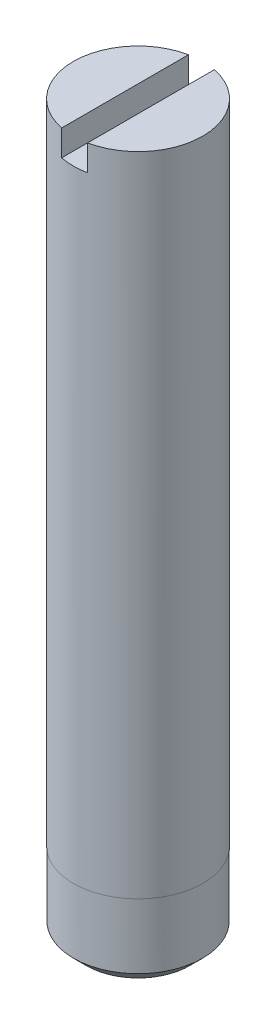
ISO-10303-21;
HEADER;
FILE_DESCRIPTION(('STEP AP214'),'2;1');
FILE_NAME('part.step','',(''),(''),'','','');
FILE_SCHEMA(('AUTOMOTIVE_DESIGN { 1 0 10303 214 1 1 1 1 }'));
ENDSEC;
DATA;
#1=APPLICATION_CONTEXT('core data for automotive mechanical design processes');
#2=APPLICATION_PROTOCOL_DEFINITION('international standard','automotive_design',2000,#1);
#3=PRODUCT_CONTEXT('',#1,'mechanical');
#4=PRODUCT('Part','Part','',(#3));
#5=PRODUCT_RELATED_PRODUCT_CATEGORY('part','',(#4));
#6=PRODUCT_DEFINITION_FORMATION('','',#4);
#7=PRODUCT_DEFINITION_CONTEXT('part definition',#1,'design');
#8=PRODUCT_DEFINITION('design','',#6,#7);
#9=PRODUCT_DEFINITION_SHAPE('','',#8);
#10=(LENGTH_UNIT() NAMED_UNIT(*) SI_UNIT(.MILLI.,.METRE.));
#11=(NAMED_UNIT(*) PLANE_ANGLE_UNIT() SI_UNIT($,.RADIAN.));
#12=(NAMED_UNIT(*) SI_UNIT($,.STERADIAN.) SOLID_ANGLE_UNIT());
#13=UNCERTAINTY_MEASURE_WITH_UNIT(LENGTH_MEASURE(1.E-05),#10,'distance_accuracy_value','');
#14=(GEOMETRIC_REPRESENTATION_CONTEXT(3) GLOBAL_UNCERTAINTY_ASSIGNED_CONTEXT((#13)) GLOBAL_UNIT_ASSIGNED_CONTEXT((#10,
#11,#12)) REPRESENTATION_CONTEXT('',''));
#15=CARTESIAN_POINT('',(0.,0.,0.));
#16=DIRECTION('',(0.,0.,1.));
#17=DIRECTION('',(1.,0.,0.));
#18=AXIS2_PLACEMENT_3D('',#15,#16,#17);
#19=CARTESIAN_POINT('',(0.,28.,0.));
#20=DIRECTION('',(0.,-1.,0.));
#21=DIRECTION('',(0.,0.,-1.));
#22=AXIS2_PLACEMENT_3D('',#19,#20,#21);
#23=CYLINDRICAL_SURFACE('',#22,2.5);
#24=CARTESIAN_POINT('',(0.,28.,0.));
#25=DIRECTION('',(0.,1.,0.));
#26=DIRECTION('',(0.,0.,1.));
#27=AXIS2_PLACEMENT_3D('',#24,#25,#26);
#28=CIRCLE('',#27,2.5);
#29=CARTESIAN_POINT('',(0.5,28.,2.44948974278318));
#30=VERTEX_POINT('',#29);
#31=CARTESIAN_POINT('',(0.5,28.,-2.44948974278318));
#32=VERTEX_POINT('',#31);
#33=EDGE_CURVE('E81',#30,#32,#28,.T.);
#34=ORIENTED_EDGE('',*,*,#33,.F.);
#35=DIRECTION('',(0.,-1.,0.));
#36=VECTOR('',#35,1.);
#37=CARTESIAN_POINT('',(0.5,28.,2.44948974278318));
#38=LINE('',#37,#36);
#39=CARTESIAN_POINT('',(0.5,27.,2.44948974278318));
#40=VERTEX_POINT('',#39);
#41=EDGE_CURVE('E92',#30,#40,#38,.T.);
#42=ORIENTED_EDGE('',*,*,#41,.T.);
#43=CARTESIAN_POINT('',(0.,27.,0.));
#44=DIRECTION('',(0.,-1.,0.));
#45=DIRECTION('',(0.,0.,-1.));
#46=AXIS2_PLACEMENT_3D('',#43,#44,#45);
#47=CIRCLE('',#46,2.5);
#48=CARTESIAN_POINT('',(-0.5,27.,2.44948974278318));
#49=VERTEX_POINT('',#48);
#50=EDGE_CURVE('E40',#40,#49,#47,.T.);
#51=ORIENTED_EDGE('',*,*,#50,.T.);
#52=DIRECTION('',(0.,-1.,0.));
#53=VECTOR('',#52,1.);
#54=CARTESIAN_POINT('',(-0.5,28.,2.44948974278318));
#55=LINE('',#54,#53);
#56=CARTESIAN_POINT('',(-0.5,28.,2.44948974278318));
#57=VERTEX_POINT('',#56);
#58=EDGE_CURVE('E75',#49,#57,#55,.F.);
#59=ORIENTED_EDGE('',*,*,#58,.T.);
#60=CARTESIAN_POINT('',(-0.5,28.,-2.44948974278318));
#61=VERTEX_POINT('',#60);
#62=EDGE_CURVE('E87',#61,#57,#28,.T.);
#63=ORIENTED_EDGE('',*,*,#62,.F.);
#64=DIRECTION('',(0.,-1.,0.));
#65=VECTOR('',#64,1.);
#66=CARTESIAN_POINT('',(-0.5,28.,-2.44948974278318));
#67=LINE('',#66,#65);
#68=CARTESIAN_POINT('',(-0.5,27.,-2.44948974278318));
#69=VERTEX_POINT('',#68);
#70=EDGE_CURVE('E47',#61,#69,#67,.T.);
#71=ORIENTED_EDGE('',*,*,#70,.T.);
#72=CARTESIAN_POINT('',(0.5,27.,-2.44948974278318));
#73=VERTEX_POINT('',#72);
#74=EDGE_CURVE('E99',#69,#73,#47,.T.);
#75=ORIENTED_EDGE('',*,*,#74,.T.);
#76=DIRECTION('',(0.,-1.,0.));
#77=VECTOR('',#76,1.);
#78=CARTESIAN_POINT('',(0.5,28.,-2.44948974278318));
#79=LINE('',#78,#77);
#80=EDGE_CURVE('E55',#73,#32,#79,.F.);
#81=ORIENTED_EDGE('',*,*,#80,.T.);
#82=EDGE_LOOP('',(#34,#42,#51,#59,#63,#71,#75,#81));
#83=FACE_BOUND('',#82,.T.);
#84=CARTESIAN_POINT('',(0.,3.,0.));
#85=DIRECTION('',(0.,-1.,0.));
#86=DIRECTION('',(0.,0.,-1.));
#87=AXIS2_PLACEMENT_3D('',#84,#85,#86);
#88=CIRCLE('',#87,2.5);
#89=CARTESIAN_POINT('',(0.,3.,-2.5));
#90=VERTEX_POINT('',#89);
#91=EDGE_CURVE('E107',#90,#90,#88,.T.);
#92=ORIENTED_EDGE('',*,*,#91,.F.);
#93=EDGE_LOOP('',(#92));
#94=FACE_BOUND('',#93,.T.);
#95=ADVANCED_FACE('F32',(#83,#94),#23,.T.);
#96=CARTESIAN_POINT('',(0.,28.,0.));
#97=DIRECTION('',(0.,1.,0.));
#98=DIRECTION('',(0.,0.,1.));
#99=AXIS2_PLACEMENT_3D('',#96,#97,#98);
#100=PLANE('',#99);
#101=DIRECTION('',(0.,0.,-1.));
#102=VECTOR('',#101,1.);
#103=CARTESIAN_POINT('',(0.5,28.,0.));
#104=LINE('',#103,#102);
#105=EDGE_CURVE('E80',#30,#32,#104,.T.);
#106=ORIENTED_EDGE('',*,*,#105,.F.);
#107=ORIENTED_EDGE('',*,*,#33,.T.);
#108=EDGE_LOOP('',(#106,#107));
#109=FACE_BOUND('',#108,.T.);
#110=ADVANCED_FACE('F124',(#109),#100,.T.);
#111=DIRECTION('',(0.,0.,1.));
#112=VECTOR('',#111,1.);
#113=CARTESIAN_POINT('',(-0.5,28.,0.));
#114=LINE('',#113,#112);
#115=EDGE_CURVE('E72',#61,#57,#114,.T.);
#116=ORIENTED_EDGE('',*,*,#115,.F.);
#117=ORIENTED_EDGE('',*,*,#62,.T.);
#118=EDGE_LOOP('',(#116,#117));
#119=FACE_BOUND('',#118,.T.);
#120=ADVANCED_FACE('F91',(#119),#100,.T.);
#121=CARTESIAN_POINT('',(0.5,27.,-3.58546058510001));
#122=DIRECTION('',(0.,-1.,0.));
#123=DIRECTION('',(0.,0.,-1.));
#124=AXIS2_PLACEMENT_3D('',#121,#122,#123);
#125=PLANE('',#124);
#126=DIRECTION('',(0.,0.,-1.));
#127=VECTOR('',#126,1.);
#128=CARTESIAN_POINT('',(0.5,27.,-3.58546058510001));
#129=LINE('',#128,#127);
#130=EDGE_CURVE('E89',#40,#73,#129,.T.);
#131=ORIENTED_EDGE('',*,*,#130,.T.);
#132=ORIENTED_EDGE('',*,*,#74,.F.);
#133=DIRECTION('',(0.,0.,1.));
#134=VECTOR('',#133,1.);
#135=CARTESIAN_POINT('',(-0.5,27.,-3.58546058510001));
#136=LINE('',#135,#134);
#137=EDGE_CURVE('E103',#69,#49,#136,.T.);
#138=ORIENTED_EDGE('',*,*,#137,.T.);
#139=ORIENTED_EDGE('',*,*,#50,.F.);
#140=EDGE_LOOP('',(#131,#132,#138,#139));
#141=FACE_BOUND('',#140,.T.);
#142=ADVANCED_FACE('F102',(#141),#125,.F.);
#143=CARTESIAN_POINT('',(0.5,27.,-3.58546058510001));
#144=DIRECTION('',(1.,0.,0.));
#145=DIRECTION('',(0.,0.,-1.));
#146=AXIS2_PLACEMENT_3D('',#143,#144,#145);
#147=PLANE('',#146);
#148=ORIENTED_EDGE('',*,*,#105,.T.);
#149=ORIENTED_EDGE('',*,*,#80,.F.);
#150=ORIENTED_EDGE('',*,*,#130,.F.);
#151=ORIENTED_EDGE('',*,*,#41,.F.);
#152=EDGE_LOOP('',(#148,#149,#150,#151));
#153=FACE_BOUND('',#152,.T.);
#154=ADVANCED_FACE('F141',(#153),#147,.F.);
#155=CARTESIAN_POINT('',(-0.5,27.,-3.58546058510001));
#156=DIRECTION('',(-1.,0.,0.));
#157=DIRECTION('',(0.,0.,1.));
#158=AXIS2_PLACEMENT_3D('',#155,#156,#157);
#159=PLANE('',#158);
#160=ORIENTED_EDGE('',*,*,#115,.T.);
#161=ORIENTED_EDGE('',*,*,#58,.F.);
#162=ORIENTED_EDGE('',*,*,#137,.F.);
#163=ORIENTED_EDGE('',*,*,#70,.F.);
#164=EDGE_LOOP('',(#160,#161,#162,#163));
#165=FACE_BOUND('',#164,.T.);
#166=ADVANCED_FACE('F74',(#165),#159,.F.);
#167=CARTESIAN_POINT('',(0.,3.,0.));
#168=DIRECTION('',(0.,-1.,0.));
#169=DIRECTION('',(0.,0.,-1.));
#170=AXIS2_PLACEMENT_3D('',#167,#168,#169);
#171=PLANE('',#170);
#172=CARTESIAN_POINT('',(0.,3.,0.));
#173=DIRECTION('',(0.,-1.,0.));
#174=DIRECTION('',(0.,0.,-1.));
#175=AXIS2_PLACEMENT_3D('',#172,#173,#174);
#176=CIRCLE('',#175,2.49);
#177=CARTESIAN_POINT('',(0.,3.,-2.49));
#178=VERTEX_POINT('',#177);
#179=EDGE_CURVE('E112',#178,#178,#176,.T.);
#180=ORIENTED_EDGE('',*,*,#179,.F.);
#181=EDGE_LOOP('',(#180));
#182=FACE_BOUND('',#181,.T.);
#183=ORIENTED_EDGE('',*,*,#91,.T.);
#184=EDGE_LOOP('',(#183));
#185=FACE_BOUND('',#184,.T.);
#186=ADVANCED_FACE('F118',(#182,#185),#171,.T.);
#187=CARTESIAN_POINT('',(0.,3.,0.));
#188=DIRECTION('',(0.,-1.,0.));
#189=DIRECTION('',(0.,0.,-1.));
#190=AXIS2_PLACEMENT_3D('',#187,#188,#189);
#191=CYLINDRICAL_SURFACE('',#190,2.49);
#192=CARTESIAN_POINT('',(0.,0.490000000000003,0.));
#193=DIRECTION('',(0.,1.,0.));
#194=DIRECTION('',(0.,0.,1.));
#195=AXIS2_PLACEMENT_3D('',#192,#193,#194);
#196=CIRCLE('',#195,2.49);
#197=CARTESIAN_POINT('',(0.,0.490000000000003,2.49));
#198=VERTEX_POINT('',#197);
#199=EDGE_CURVE('E35',#198,#198,#196,.F.);
#200=ORIENTED_EDGE('',*,*,#199,.F.);
#201=EDGE_LOOP('',(#200));
#202=FACE_BOUND('',#201,.T.);
#203=ORIENTED_EDGE('',*,*,#179,.T.);
#204=EDGE_LOOP('',(#203));
#205=FACE_BOUND('',#204,.T.);
#206=ADVANCED_FACE('F116',(#202,#205),#191,.T.);
#207=CARTESIAN_POINT('',(0.,0.,0.));
#208=DIRECTION('',(0.,1.,0.));
#209=DIRECTION('',(0.,0.,1.));
#210=AXIS2_PLACEMENT_3D('',#207,#208,#209);
#211=PLANE('',#210);
#212=CARTESIAN_POINT('',(0.,0.,0.));
#213=DIRECTION('',(0.,1.,0.));
#214=DIRECTION('',(0.,0.,1.));
#215=AXIS2_PLACEMENT_3D('',#212,#213,#214);
#216=CIRCLE('',#215,2.);
#217=CARTESIAN_POINT('',(0.,0.,2.));
#218=VERTEX_POINT('',#217);
#219=EDGE_CURVE('E11',#218,#218,#216,.F.);
#220=ORIENTED_EDGE('',*,*,#219,.T.);
#221=EDGE_LOOP('',(#220));
#222=FACE_BOUND('',#221,.T.);
#223=ADVANCED_FACE('F134',(#222),#211,.F.);
#224=CARTESIAN_POINT('',(0.,0.500000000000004,0.));
#225=DIRECTION('',(0.,1.,0.));
#226=DIRECTION('',(0.,0.,1.));
#227=AXIS2_PLACEMENT_3D('',#224,#225,#226);
#228=CONICAL_SURFACE('',#227,2.5,0.785398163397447);
#229=ORIENTED_EDGE('',*,*,#219,.F.);
#230=EDGE_LOOP('',(#229));
#231=FACE_BOUND('',#230,.T.);
#232=ORIENTED_EDGE('',*,*,#199,.T.);
#233=EDGE_LOOP('',(#232));
#234=FACE_BOUND('',#233,.T.);
#235=ADVANCED_FACE('F137',(#231,#234),#228,.T.);
#236=CLOSED_SHELL('',(#95,#110,#120,#142,#154,#166,#186,#206,#223,#235));
#237=MANIFOLD_SOLID_BREP('B2',#236);
#238=ADVANCED_BREP_SHAPE_REPRESENTATION('',(#18,#237),#14);
#239=SHAPE_DEFINITION_REPRESENTATION(#9,#238);
ENDSEC;
END-ISO-10303-21;
